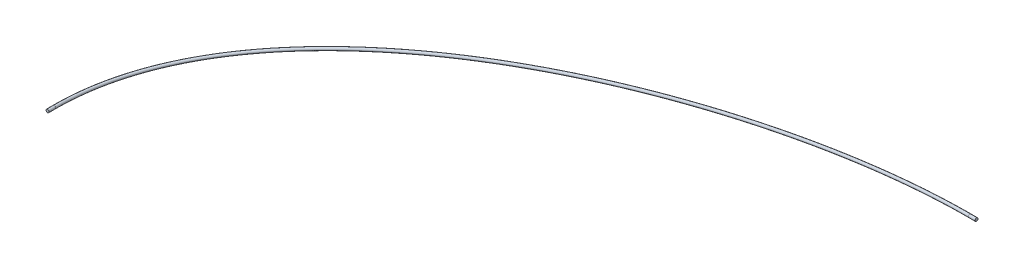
ISO-10303-21;
HEADER;
FILE_DESCRIPTION(('STEP AP214'),'2;1');
FILE_NAME('part.step','',(''),(''),'','','');
FILE_SCHEMA(('AUTOMOTIVE_DESIGN { 1 0 10303 214 1 1 1 1 }'));
ENDSEC;
DATA;
#1=APPLICATION_CONTEXT('core data for automotive mechanical design processes');
#2=APPLICATION_PROTOCOL_DEFINITION('international standard','automotive_design',2000,#1);
#3=PRODUCT_CONTEXT('',#1,'mechanical');
#4=PRODUCT('Part','Part','',(#3));
#5=PRODUCT_RELATED_PRODUCT_CATEGORY('part','',(#4));
#6=PRODUCT_DEFINITION_FORMATION('','',#4);
#7=PRODUCT_DEFINITION_CONTEXT('part definition',#1,'design');
#8=PRODUCT_DEFINITION('design','',#6,#7);
#9=PRODUCT_DEFINITION_SHAPE('','',#8);
#10=(LENGTH_UNIT() NAMED_UNIT(*) SI_UNIT(.MILLI.,.METRE.));
#11=(NAMED_UNIT(*) PLANE_ANGLE_UNIT() SI_UNIT($,.RADIAN.));
#12=(NAMED_UNIT(*) SI_UNIT($,.STERADIAN.) SOLID_ANGLE_UNIT());
#13=UNCERTAINTY_MEASURE_WITH_UNIT(LENGTH_MEASURE(1.E-05),#10,'distance_accuracy_value','');
#14=(GEOMETRIC_REPRESENTATION_CONTEXT(3) GLOBAL_UNCERTAINTY_ASSIGNED_CONTEXT((#13)) GLOBAL_UNIT_ASSIGNED_CONTEXT((#10,
#11,#12)) REPRESENTATION_CONTEXT('',''));
#15=CARTESIAN_POINT('',(0.,0.,0.));
#16=DIRECTION('',(0.,0.,1.));
#17=DIRECTION('',(1.,0.,0.));
#18=AXIS2_PLACEMENT_3D('',#15,#16,#17);
#19=CARTESIAN_POINT('',(-254.,76.2,215.387));
#20=DIRECTION('',(0.,0.,1.));
#21=DIRECTION('',(1.,0.,0.));
#22=AXIS2_PLACEMENT_3D('',#19,#20,#21);
#23=CYLINDRICAL_SURFACE('',#22,1.58749999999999);
#24=CARTESIAN_POINT('',(-254.,76.2,215.387));
#25=DIRECTION('',(0.,0.,1.));
#26=DIRECTION('',(0.937554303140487,0.34783894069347,0.));
#27=AXIS2_PLACEMENT_3D('',#24,#25,#26);
#28=CIRCLE('',#27,1.58749999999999);
#29=CARTESIAN_POINT('',(-252.511632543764,76.7521943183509,215.387));
#30=VERTEX_POINT('',#29);
#31=EDGE_CURVE('E62',#30,#30,#28,.T.);
#32=ORIENTED_EDGE('',*,*,#31,.T.);
#33=EDGE_LOOP('',(#32));
#34=FACE_BOUND('',#33,.T.);
#35=CARTESIAN_POINT('',(-254.,76.2,222.387));
#36=DIRECTION('',(0.,0.,1.));
#37=DIRECTION('',(0.937554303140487,0.34783894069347,0.));
#38=AXIS2_PLACEMENT_3D('',#35,#36,#37);
#39=CIRCLE('',#38,1.58749999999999);
#40=CARTESIAN_POINT('',(-252.511632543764,76.7521943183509,222.387));
#41=VERTEX_POINT('',#40);
#42=EDGE_CURVE('E11',#41,#41,#39,.T.);
#43=ORIENTED_EDGE('',*,*,#42,.F.);
#44=EDGE_LOOP('',(#43));
#45=FACE_BOUND('',#44,.T.);
#46=ADVANCED_FACE('F47',(#34,#45),#23,.T.);
#47=CARTESIAN_POINT('',(358.887,107.95,-135.9));
#48=DIRECTION('',(1.,0.,0.));
#49=DIRECTION('',(0.,0.,-1.));
#50=AXIS2_PLACEMENT_3D('',#47,#48,#49);
#51=CYLINDRICAL_SURFACE('',#50,1.58749999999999);
#52=CARTESIAN_POINT('',(358.887,107.95,-135.9));
#53=DIRECTION('',(-1.,0.,0.));
#54=DIRECTION('',(0.,0.,1.));
#55=AXIS2_PLACEMENT_3D('',#52,#53,#54);
#56=CIRCLE('',#55,1.58749999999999);
#57=CARTESIAN_POINT('',(358.887,107.95,-137.4875));
#58=VERTEX_POINT('',#57);
#59=EDGE_CURVE('E53',#58,#58,#56,.T.);
#60=CARTESIAN_POINT('',(365.887,107.95,-135.9));
#61=DIRECTION('',(-1.,0.,0.));
#62=DIRECTION('',(0.,0.,1.));
#63=AXIS2_PLACEMENT_3D('',#60,#61,#62);
#64=CIRCLE('',#63,1.58749999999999);
#65=CARTESIAN_POINT('',(365.887,107.95,-137.4875));
#66=VERTEX_POINT('',#65);
#67=EDGE_CURVE('E57',#66,#66,#64,.T.);
#68=CARTESIAN_POINT('',(358.887,107.95,-137.4875));
#69=CARTESIAN_POINT('',(358.959916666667,107.95,-137.4875));
#70=CARTESIAN_POINT('',(359.032833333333,107.95,-137.4875));
#71=CARTESIAN_POINT('',(359.178666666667,107.95,-137.4875));
#72=CARTESIAN_POINT('',(359.251583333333,107.95,-137.4875));
#73=CARTESIAN_POINT('',(359.397416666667,107.95,-137.4875));
#74=CARTESIAN_POINT('',(359.470333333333,107.95,-137.4875));
#75=CARTESIAN_POINT('',(359.616166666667,107.95,-137.4875));
#76=CARTESIAN_POINT('',(359.689083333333,107.95,-137.4875));
#77=CARTESIAN_POINT('',(359.834916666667,107.95,-137.4875));
#78=CARTESIAN_POINT('',(359.907833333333,107.95,-137.4875));
#79=CARTESIAN_POINT('',(360.053666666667,107.95,-137.4875));
#80=CARTESIAN_POINT('',(360.126583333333,107.95,-137.4875));
#81=CARTESIAN_POINT('',(360.272416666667,107.95,-137.4875));
#82=CARTESIAN_POINT('',(360.345333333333,107.95,-137.4875));
#83=CARTESIAN_POINT('',(360.491166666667,107.95,-137.4875));
#84=CARTESIAN_POINT('',(360.564083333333,107.95,-137.4875));
#85=CARTESIAN_POINT('',(360.709916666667,107.95,-137.4875));
#86=CARTESIAN_POINT('',(360.782833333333,107.95,-137.4875));
#87=CARTESIAN_POINT('',(360.928666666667,107.95,-137.4875));
#88=CARTESIAN_POINT('',(361.001583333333,107.95,-137.4875));
#89=CARTESIAN_POINT('',(361.147416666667,107.95,-137.4875));
#90=CARTESIAN_POINT('',(361.220333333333,107.95,-137.4875));
#91=CARTESIAN_POINT('',(361.366166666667,107.95,-137.4875));
#92=CARTESIAN_POINT('',(361.439083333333,107.95,-137.4875));
#93=CARTESIAN_POINT('',(361.584916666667,107.95,-137.4875));
#94=CARTESIAN_POINT('',(361.657833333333,107.95,-137.4875));
#95=CARTESIAN_POINT('',(361.803666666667,107.95,-137.4875));
#96=CARTESIAN_POINT('',(361.876583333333,107.95,-137.4875));
#97=CARTESIAN_POINT('',(362.022416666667,107.95,-137.4875));
#98=CARTESIAN_POINT('',(362.095333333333,107.95,-137.4875));
#99=CARTESIAN_POINT('',(362.241166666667,107.95,-137.4875));
#100=CARTESIAN_POINT('',(362.314083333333,107.95,-137.4875));
#101=CARTESIAN_POINT('',(362.459916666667,107.95,-137.4875));
#102=CARTESIAN_POINT('',(362.532833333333,107.95,-137.4875));
#103=CARTESIAN_POINT('',(362.678666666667,107.95,-137.4875));
#104=CARTESIAN_POINT('',(362.751583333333,107.95,-137.4875));
#105=CARTESIAN_POINT('',(362.897416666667,107.95,-137.4875));
#106=CARTESIAN_POINT('',(362.970333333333,107.95,-137.4875));
#107=CARTESIAN_POINT('',(363.116166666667,107.95,-137.4875));
#108=CARTESIAN_POINT('',(363.189083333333,107.95,-137.4875));
#109=CARTESIAN_POINT('',(363.334916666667,107.95,-137.4875));
#110=CARTESIAN_POINT('',(363.407833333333,107.95,-137.4875));
#111=CARTESIAN_POINT('',(363.553666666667,107.95,-137.4875));
#112=CARTESIAN_POINT('',(363.626583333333,107.95,-137.4875));
#113=CARTESIAN_POINT('',(363.772416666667,107.95,-137.4875));
#114=CARTESIAN_POINT('',(363.845333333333,107.95,-137.4875));
#115=CARTESIAN_POINT('',(363.991166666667,107.95,-137.4875));
#116=CARTESIAN_POINT('',(364.064083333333,107.95,-137.4875));
#117=CARTESIAN_POINT('',(364.209916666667,107.95,-137.4875));
#118=CARTESIAN_POINT('',(364.282833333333,107.95,-137.4875));
#119=CARTESIAN_POINT('',(364.428666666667,107.95,-137.4875));
#120=CARTESIAN_POINT('',(364.501583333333,107.95,-137.4875));
#121=CARTESIAN_POINT('',(364.647416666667,107.95,-137.4875));
#122=CARTESIAN_POINT('',(364.720333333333,107.95,-137.4875));
#123=CARTESIAN_POINT('',(364.866166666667,107.95,-137.4875));
#124=CARTESIAN_POINT('',(364.939083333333,107.95,-137.4875));
#125=CARTESIAN_POINT('',(365.084916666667,107.95,-137.4875));
#126=CARTESIAN_POINT('',(365.157833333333,107.95,-137.4875));
#127=CARTESIAN_POINT('',(365.303666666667,107.95,-137.4875));
#128=CARTESIAN_POINT('',(365.376583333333,107.95,-137.4875));
#129=CARTESIAN_POINT('',(365.522416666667,107.95,-137.4875));
#130=CARTESIAN_POINT('',(365.595333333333,107.95,-137.4875));
#131=CARTESIAN_POINT('',(365.741166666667,107.95,-137.4875));
#132=CARTESIAN_POINT('',(365.814083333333,107.95,-137.4875));
#133=CARTESIAN_POINT('',(365.887,107.95,-137.4875));
#134=B_SPLINE_CURVE_WITH_KNOTS('',3,(#68,#69,#70,#71,#72,#73,#74,#75,#76,#77,#78,#79,#80,#81,
#82,#83,#84,#85,#86,#87,#88,#89,#90,#91,#92,#93,#94,#95,#96,#97,#98,#99,#100,#101,#102,#103,
#104,#105,#106,#107,#108,#109,#110,#111,#112,#113,#114,#115,#116,#117,#118,#119,#120,#121,#122,
#123,#124,#125,#126,#127,#128,#129,#130,#131,#132,#133),.UNSPECIFIED.,.F.,.F.,(4,2,2,2,2,2,2,2,
2,2,2,2,2,2,2,2,2,2,2,2,2,2,2,2,2,2,2,2,2,2,2,2,4),(0.,0.218750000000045,0.437500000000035,
0.656250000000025,0.875000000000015,1.09375,1.31250000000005,1.53125000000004,1.75000000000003,
1.96875000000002,2.18750000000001,2.40625000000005,2.62500000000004,2.84375000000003,
3.06250000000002,3.28125000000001,3.5,3.71875000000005,3.93750000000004,4.15625000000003,
4.37500000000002,4.59375000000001,4.81250000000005,5.03125000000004,5.25000000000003,
5.46875000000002,5.68750000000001,5.90625000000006,6.12500000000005,6.34375000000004,
6.56250000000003,6.78125000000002,7.00000000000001),.UNSPECIFIED.);
#135=EDGE_CURVE('BSEAM81',#58,#66,#134,.T.);
#136=ORIENTED_EDGE('',*,*,#59,.F.);
#137=ORIENTED_EDGE('',*,*,#67,.T.);
#138=ORIENTED_EDGE('',*,*,#135,.T.);
#139=ORIENTED_EDGE('',*,*,#135,.F.);
#140=EDGE_LOOP('',(#136,#138,#137,#139));
#141=FACE_BOUND('',#140,.T.);
#142=ADVANCED_FACE('F81',(#141),#51,.T.);
#143=CARTESIAN_POINT('',(365.887,107.95,-135.9));
#144=DIRECTION('',(-1.,0.,0.));
#145=DIRECTION('',(0.,0.,1.));
#146=AXIS2_PLACEMENT_3D('',#143,#144,#145);
#147=PLANE('',#146);
#148=ORIENTED_EDGE('',*,*,#67,.F.);
#149=EDGE_LOOP('',(#148));
#150=FACE_BOUND('',#149,.T.);
#151=ADVANCED_FACE('F76',(#150),#147,.F.);
#152=CARTESIAN_POINT('',(-254.,76.2,222.387));
#153=DIRECTION('',(0.,0.,1.));
#154=DIRECTION('',(0.937554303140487,0.34783894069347,0.));
#155=AXIS2_PLACEMENT_3D('',#152,#153,#154);
#156=PLANE('',#155);
#157=ORIENTED_EDGE('',*,*,#42,.T.);
#158=EDGE_LOOP('',(#157));
#159=FACE_BOUND('',#158,.T.);
#160=ADVANCED_FACE('F71',(#159),#156,.T.);
#161=CARTESIAN_POINT('',(358.887,107.95,-134.3125));
#162=CARTESIAN_POINT('',(319.480162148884,107.95,-134.3125));
#163=CARTESIAN_POINT('',(233.149479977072,106.363782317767,-127.98357625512));
#164=CARTESIAN_POINT('',(94.407865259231,100.304943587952,-99.2479711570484));
#165=CARTESIAN_POINT('',(-27.7738544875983,93.1270317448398,-55.0499429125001));
#166=CARTESIAN_POINT('',(-124.438445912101,86.5715370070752,-0.531082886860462));
#167=CARTESIAN_POINT('',(-186.48437820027,81.9816745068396,52.9714111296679));
#168=CARTESIAN_POINT('',(-225.735457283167,78.9261025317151,106.964698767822));
#169=CARTESIAN_POINT('',(-247.318234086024,77.1821309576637,158.304100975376));
#170=CARTESIAN_POINT('',(-252.511632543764,76.7521943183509,195.631586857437));
#171=CARTESIAN_POINT('',(-252.511632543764,76.7521943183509,215.387));
#172=CARTESIAN_POINT('',(358.887,111.125,-134.3125));
#173=CARTESIAN_POINT('',(319.258224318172,111.125,-134.3125));
#174=CARTESIAN_POINT('',(233.089984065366,109.527198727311,-128.32545320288));
#175=CARTESIAN_POINT('',(94.0812875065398,103.422430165,-99.775750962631));
#176=CARTESIAN_POINT('',(-28.2447306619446,96.2005014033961,-55.6980571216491));
#177=CARTESIAN_POINT('',(-125.094106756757,89.6110719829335,-1.18669821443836));
#178=CARTESIAN_POINT('',(-187.304602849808,84.9972841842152,52.4158073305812));
#179=CARTESIAN_POINT('',(-226.703699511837,81.9226112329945,106.502798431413));
#180=CARTESIAN_POINT('',(-248.385834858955,80.1664413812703,158.229117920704));
#181=CARTESIAN_POINT('',(-253.616021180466,79.728929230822,195.22380872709));
#182=CARTESIAN_POINT('',(-253.616021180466,79.728929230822,215.387));
#183=CARTESIAN_POINT('',(358.887,111.125,-137.4875));
#184=CARTESIAN_POINT('',(319.258224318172,111.125,-137.4875));
#185=CARTESIAN_POINT('',(232.568052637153,109.171856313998,-131.466962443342));
#186=CARTESIAN_POINT('',(93.2907980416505,102.837542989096,-102.798511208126));
#187=CARTESIAN_POINT('',(-29.4554053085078,95.4193545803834,-58.5468464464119));
#188=CARTESIAN_POINT('',(-126.772044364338,88.7117479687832,-3.74502360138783));
#189=CARTESIAN_POINT('',(-189.465021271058,84.0172685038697,50.2500555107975));
#190=CARTESIAN_POINT('',(-229.306647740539,80.8801283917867,104.990245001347));
#191=CARTESIAN_POINT('',(-251.292529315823,79.0841239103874,157.274741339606));
#192=CARTESIAN_POINT('',(-256.592756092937,78.6245405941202,195.22380872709));
#193=CARTESIAN_POINT('',(-256.592756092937,78.6245405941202,215.387));
#194=CARTESIAN_POINT('',(358.887,107.95,-137.4875));
#195=CARTESIAN_POINT('',(319.369193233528,107.95,-137.4875));
#196=CARTESIAN_POINT('',(232.67909033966,106.008439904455,-131.124982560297));
#197=CARTESIAN_POINT('',(93.6034328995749,99.7200564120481,-102.27109167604));
#198=CARTESIAN_POINT('',(-28.9818137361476,92.345884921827,-57.8975356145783));
#199=CARTESIAN_POINT('',(-126.117029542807,85.6722129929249,-3.09265073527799));
#200=CARTESIAN_POINT('',(-188.644686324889,81.0016588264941,50.8161587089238));
#201=CARTESIAN_POINT('',(-228.338430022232,77.8836196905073,105.427157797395));
#202=CARTESIAN_POINT('',(-250.224921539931,76.0998134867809,157.444244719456));
#203=CARTESIAN_POINT('',(-255.488367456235,75.6478056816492,195.427697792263));
#204=CARTESIAN_POINT('',(-255.488367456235,75.6478056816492,215.387));
#205=CARTESIAN_POINT('',(358.887,104.775,-137.4875));
#206=CARTESIAN_POINT('',(319.480162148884,104.775,-137.4875));
#207=CARTESIAN_POINT('',(232.790128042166,102.845023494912,-130.783002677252));
#208=CARTESIAN_POINT('',(93.9160677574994,96.6025698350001,-101.743672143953));
#209=CARTESIAN_POINT('',(-28.5082221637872,89.2724152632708,-57.2482247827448));
#210=CARTESIAN_POINT('',(-125.462014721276,82.6326780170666,-2.44027786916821));
#211=CARTESIAN_POINT('',(-187.824351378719,77.9860491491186,51.38226190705));
#212=CARTESIAN_POINT('',(-227.370212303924,74.8871109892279,105.864070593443));
#213=CARTESIAN_POINT('',(-249.15731376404,73.1155030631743,157.613748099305));
#214=CARTESIAN_POINT('',(-254.383978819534,72.6710707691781,195.631586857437));
#215=CARTESIAN_POINT('',(-254.383978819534,72.6710707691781,215.387));
#216=CARTESIAN_POINT('',(358.887,104.775,-134.3125));
#217=CARTESIAN_POINT('',(319.702099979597,104.775,-134.3125));
#218=CARTESIAN_POINT('',(233.208975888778,103.200365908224,-127.641699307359));
#219=CARTESIAN_POINT('',(94.7344430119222,97.1874570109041,-98.7201913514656));
#220=CARTESIAN_POINT('',(-27.3029783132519,90.0535620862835,-54.4018287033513));
#221=CARTESIAN_POINT('',(-123.782785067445,83.5320020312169,0.124532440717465));
#222=CARTESIAN_POINT('',(-185.664153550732,78.966064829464,53.5270149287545));
#223=CARTESIAN_POINT('',(-224.767215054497,75.9295938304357,107.426599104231));
#224=CARTESIAN_POINT('',(-246.250633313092,74.1978205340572,158.379084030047));
#225=CARTESIAN_POINT('',(-251.407243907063,73.7754594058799,196.039364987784));
#226=CARTESIAN_POINT('',(-251.407243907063,73.7754594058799,215.387));
#227=CARTESIAN_POINT('',(358.887,107.95,-134.3125));
#228=CARTESIAN_POINT('',(319.480162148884,107.95,-134.3125));
#229=CARTESIAN_POINT('',(233.149479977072,106.363782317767,-127.98357625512));
#230=CARTESIAN_POINT('',(94.407865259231,100.304943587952,-99.2479711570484));
#231=CARTESIAN_POINT('',(-27.7738544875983,93.1270317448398,-55.0499429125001));
#232=CARTESIAN_POINT('',(-124.438445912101,86.5715370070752,-0.531082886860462));
#233=CARTESIAN_POINT('',(-186.48437820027,81.9816745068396,52.9714111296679));
#234=CARTESIAN_POINT('',(-225.735457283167,78.9261025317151,106.964698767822));
#235=CARTESIAN_POINT('',(-247.318234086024,77.1821309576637,158.304100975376));
#236=CARTESIAN_POINT('',(-252.511632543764,76.7521943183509,195.631586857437));
#237=CARTESIAN_POINT('',(-252.511632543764,76.7521943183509,215.387));
#238=(BOUNDED_SURFACE() B_SPLINE_SURFACE(3,3,((#161,#162,#163,#164,#165,#166,#167,#168,#169,
#170,#171),(#172,#173,#174,#175,#176,#177,#178,#179,#180,#181,#182),(#183,#184,#185,#186,#187,
#188,#189,#190,#191,#192,#193),(#194,#195,#196,#197,#198,#199,#200,#201,#202,#203,#204),(#205,
#206,#207,#208,#209,#210,#211,#212,#213,#214,#215),(#216,#217,#218,#219,#220,#221,#222,#223,
#224,#225,#226),(#227,#228,#229,#230,#231,#232,#233,#234,#235,#236,#237)),.UNSPECIFIED.,.T.,.F.,
.F.) B_SPLINE_SURFACE_WITH_KNOTS((4,3,4),(4,1,1,1,1,1,1,1,4),(0.,0.5,1.),(0.,0.166666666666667,
0.333333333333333,0.5,0.625,0.75,0.833333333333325,0.916666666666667,1.),
.UNSPECIFIED.) GEOMETRIC_REPRESENTATION_ITEM() RATIONAL_B_SPLINE_SURFACE(((1.,1.,1.,1.,1.,1.,1.,
1.,1.,1.,1.),(0.333333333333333,0.333333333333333,0.333333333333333,0.333333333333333,
0.333333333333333,0.333333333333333,0.333333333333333,0.333333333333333,0.333333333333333,
0.333333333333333,0.333333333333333),(0.333333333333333,0.333333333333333,0.333333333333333,
0.333333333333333,0.333333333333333,0.333333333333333,0.333333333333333,0.333333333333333,
0.333333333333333,0.333333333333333,0.333333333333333),(1.,1.,1.,1.,1.,1.,1.,1.,1.,1.,1.),
(0.333333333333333,0.333333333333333,0.333333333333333,0.333333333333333,0.333333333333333,
0.333333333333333,0.333333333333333,0.333333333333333,0.333333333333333,0.333333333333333,
0.333333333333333),(0.333333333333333,0.333333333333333,0.333333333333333,0.333333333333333,
0.333333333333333,0.333333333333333,0.333333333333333,0.333333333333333,0.333333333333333,
0.333333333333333,0.333333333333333),(1.,1.,1.,1.,1.,1.,1.,1.,1.,1.,1.))) REPRESENTATION_ITEM('') SURFACE());
#239=ORIENTED_EDGE('',*,*,#59,.T.);
#240=EDGE_LOOP('',(#239));
#241=FACE_BOUND('',#240,.T.);
#242=ORIENTED_EDGE('',*,*,#31,.F.);
#243=EDGE_LOOP('',(#242));
#244=FACE_BOUND('',#243,.T.);
#245=ADVANCED_FACE('F69',(#241,#244),#238,.T.);
#246=CLOSED_SHELL('',(#46,#142,#151,#160,#245));
#247=MANIFOLD_SOLID_BREP('B2',#246);
#248=ADVANCED_BREP_SHAPE_REPRESENTATION('',(#18,#247),#14);
#249=SHAPE_DEFINITION_REPRESENTATION(#9,#248);
ENDSEC;
END-ISO-10303-21;
